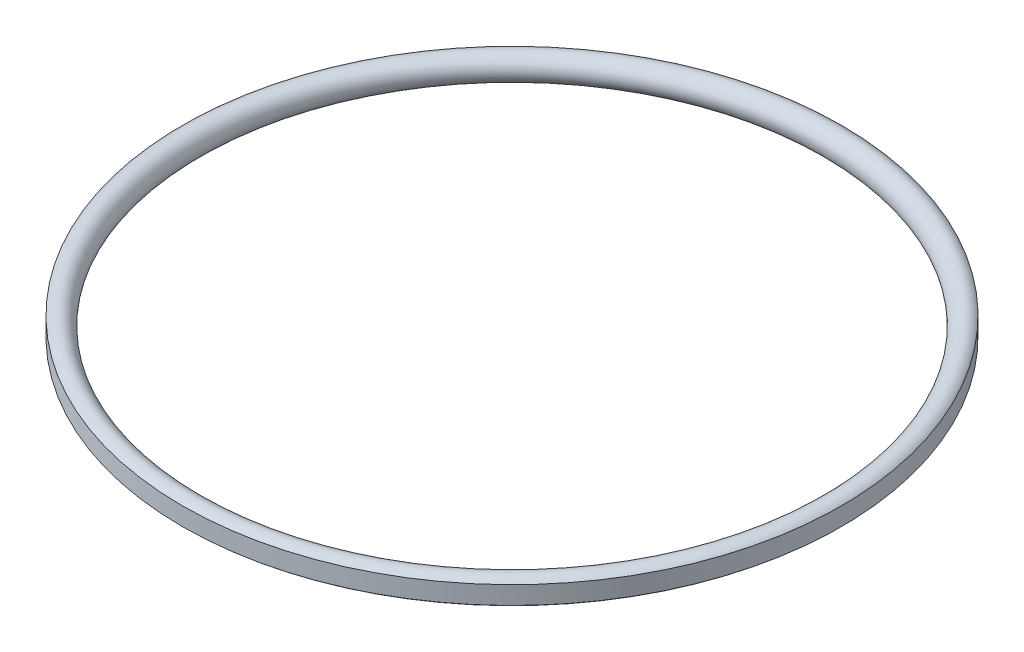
from build123d import *

# Parameters (mm, degrees)
ESQUISSE1_R         = 2.665
ESQUISSE3_OUTSIDE_W = 180.792
ESQUISSE3_OUTSIDE_H = 180.792
ESQUISSE3_OUTSIDE_R = 68.9
TRONQUAGE_DEPTH     = 33.7


with BuildPart() as part:
    # Esquisse1 → Base-R_volution (revolve)
    with BuildSketch(Plane.XY, mode=Mode.PRIVATE) as base_r_volution_sk:
        with Locations((-67.015, 2.665)):
            Circle(ESQUISSE1_R)
    revolve(base_r_volution_sk.sketch.rotate(Axis((0, 0, 0), (0, 1, 0)), 270), axis=Axis((0, 0, 0), (0, 1, 0)))

    # Esquisse3 outside → Tronquage (cut)
    with BuildSketch(Plane(origin=(0, 0, 0), x_dir=(1, 0, 0), z_dir=(0, 1, 0))):
        Rectangle(ESQUISSE3_OUTSIDE_W, ESQUISSE3_OUTSIDE_H)
        with Locations(Location((0, 0, 0), (0, 0, 90))):
            Circle(ESQUISSE3_OUTSIDE_R, mode=Mode.SUBTRACT)
    extrude(amount=TRONQUAGE_DEPTH, mode=Mode.SUBTRACT)


solid = part.part
